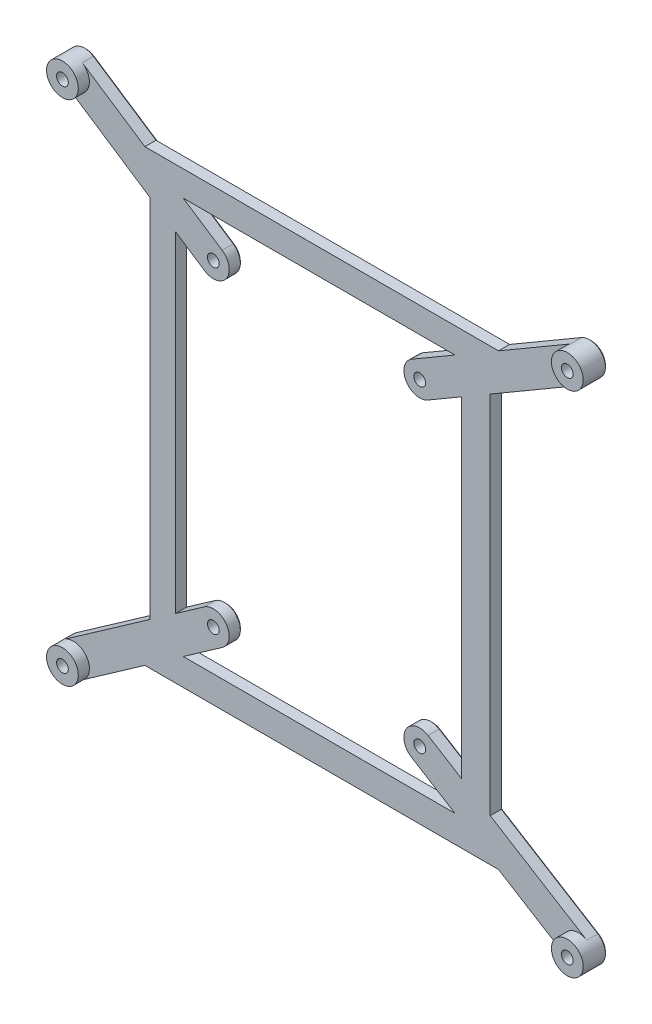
from build123d import *

# Parameters (mm, degrees)
SKIZZE1_R                       = 1.85
AUFSATZ_LINEAR_AUSTRAGEN1_DEPTH = 4
AUFSATZ_LINEAR_START            = 3.5
SKIZZE5_R                       = 5
SKIZZE5_R_2                     = 1.85
SKIZZE5_R_3                     = 5.007765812
AUFSATZ_LINEAR_AUSTRAGEN2_DEPTH = 3.5
FASE1_SIZE                      = 0.5


with BuildPart() as part:
    # Skizze1 → Aufsatz-Linear austragen1 (new body)
    with BuildSketch(Plane.XY):
        with BuildLine():
            Line((82.131309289, -75.729257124), (51.73225298, -56.955695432))
            Line((51.73225298, -56.955695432), (51.73225298, 58.029185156))
            Line((51.73225298, 58.029185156), (82.018763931, 75.690760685))
            ThreePointArc((82.018763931, 75.690760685), (83.819239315, 82.528763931), (76.981236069, 84.329239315))
            Line((76.981236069, 84.329239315), (54.347088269, 71.130138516))
            Line((54.347088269, 71.130138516), (-57.023078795, 71.130138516))
            Line((-57.023078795, 71.130138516), (-76.740500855, 84.179552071))
            ThreePointArc((-76.740500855, 84.179552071), (-83.669552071, 82.769499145), (-82.259499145, 75.840447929))
            Line((-82.259499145, 75.840447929), (-55.347011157, 58.029185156))
            Line((-55.347011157, 58.029185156), (-55.347011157, -56.955695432))
            Line((-55.347011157, -56.955695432), (-82.369745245, -75.895544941))
            ThreePointArc((-82.369745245, -75.895544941), (-83.594455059, -82.859745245), (-76.630254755, -84.084455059))
            Line((-76.630254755, -84.084455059), (-57.023078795, -70.342064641))
            Line((-57.023078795, -70.342064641), (54.347088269, -70.342064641))
            Line((54.347088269, -70.342064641), (76.868690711, -84.250742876))
            ThreePointArc((76.868690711, -84.250742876), (83.760742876, -82.621309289), (82.131309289, -75.729257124))
        make_face()
        with Locations((-35.469999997, -49.13)):
            Circle(SKIZZE1_R, mode=Mode.SUBTRACT)
        with Locations((29.530000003, -49.13)):
            Circle(SKIZZE1_R, mode=Mode.SUBTRACT)
        with Locations(Location((29.530000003, 50.87, 0), (0, 0, 180))):
            Circle(SKIZZE1_R, mode=Mode.SUBTRACT)
        with Locations(Location((-35.469999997, 50.87, 0), (0, 0, 180))):
            Circle(SKIZZE1_R, mode=Mode.SUBTRACT)
        with Locations((-79.5, 80.01)):
            Circle(SKIZZE1_R, mode=Mode.SUBTRACT)
        with Locations((79.5, 80.01)):
            Circle(SKIZZE1_R, mode=Mode.SUBTRACT)
        with Locations((79.5, -79.99)):
            Circle(SKIZZE1_R, mode=Mode.SUBTRACT)
        with Locations((-79.5, -79.99)):
            Circle(SKIZZE1_R, mode=Mode.SUBTRACT)
        with BuildLine():
            Line((-38.339745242, -45.035544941), (-47.347011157, -51.348609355))
            Line((-47.347011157, -51.348609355), (-47.347011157, 52.734613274))
            Line((-47.347011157, 52.734613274), (-38.229499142, 46.700447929))
            ThreePointArc((-38.229499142, 46.700447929), (-31.300447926, 48.110500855), (-32.710500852, 55.039552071))
            Line((-32.710500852, 55.039552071), (-44.935227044, 63.130138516))
            Line((-44.935227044, 63.130138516), (40.628488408, 63.130138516))
            Line((40.628488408, 63.130138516), (27.011236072, 55.189239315))
            ThreePointArc((27.011236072, 55.189239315), (25.210760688, 48.351236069), (32.048763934, 46.550760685))
            Line((32.048763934, 46.550760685), (42.652988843, 52.734613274))
            Line((42.652988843, 52.734613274), (42.652988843, -51.348609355))
            Line((42.652988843, -51.348609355), (32.161309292, -44.869257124))
            ThreePointArc((32.161309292, -44.869257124), (25.269257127, -46.498690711), (26.898690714, -53.390742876))
            Line((26.898690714, -53.390742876), (40.628488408, -61.869861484))
            Line((40.628488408, -61.869861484), (-44.935227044, -61.869861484))
            Line((-44.935227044, -61.869861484), (-32.600254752, -53.224455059))
            ThreePointArc((-32.600254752, -53.224455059), (-31.375544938, -46.260254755), (-38.339745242, -45.035544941))
        make_face(mode=Mode.SUBTRACT)
    extrude(amount=-AUFSATZ_LINEAR_AUSTRAGEN1_DEPTH)

    # Skizze5 → Aufsatz-Linear austragen2 (add)
    # profile 1 of 4: a face of its own
    with BuildSketch(Plane.XY.offset(AUFSATZ_LINEAR_START)):
        with Locations((-79.5, -79.99)):
            Circle(SKIZZE5_R)
        with Locations((-79.5, -79.99)):
            Circle(SKIZZE5_R_2, mode=Mode.SUBTRACT)
    # profile 2 of 4: a face of its own
    with BuildSketch(Plane.XY.offset(AUFSATZ_LINEAR_START)):
        with Locations((79.5, -79.99)):
            Circle(SKIZZE5_R_3)
        with Locations((79.5, -79.99)):
            Circle(SKIZZE5_R_2, mode=Mode.SUBTRACT)
    # profile 3 of 4: a face of its own
    with BuildSketch(Plane.XY.offset(AUFSATZ_LINEAR_START)):
        with Locations((-79.5, 80.01)):
            Circle(SKIZZE5_R)
        with Locations((-79.5, 80.01)):
            Circle(SKIZZE5_R_2, mode=Mode.SUBTRACT)
    # profile 4 of 4: a face of its own
    with BuildSketch(Plane.XY.offset(AUFSATZ_LINEAR_START)):
        with Locations((79.5, 80.01)):
            Circle(SKIZZE5_R)
        with Locations((79.5, 80.01)):
            Circle(SKIZZE5_R_2, mode=Mode.SUBTRACT)
    extrude(amount=-AUFSATZ_LINEAR_AUSTRAGEN2_DEPTH)

    # Fase1
    fase1_edges = [part.edges().sort_by_distance(p)[0] for p in [
        (-81.35, -79.99, -4),
        (31.380000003, 50.87, -4),
        (-33.619999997, 50.87, -4),
        (-81.35, 80.01, -4),
        (-68.858378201, -66.425620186, -4),
        (-83.594455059, -82.859745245, -4),
        (-66.826666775, -77.21325985, -4),
        (-1.337995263, -70.342064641, -4),
        (65.60788949, -77.296403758, -4),
        (83.760742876, -82.621309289, -4),
        (66.931781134, -66.342476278, -4),
        (51.73225298, 0.536744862, -4),
        (66.875508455, 66.859972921, -4),
        (83.819239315, 82.528763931, -4),
        (-68.803255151, 66.934816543, -4),
        (-31.375544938, -46.260254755, -4),
        (-42.843378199, -48.192077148, -4),
        (65.664162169, 77.729688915, -4),
        (-47.347011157, 0.69300196, -4),
        (-42.788255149, 49.717530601, -4),
        (-31.300447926, 48.110500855, -4),
        (-38.822863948, 59.084845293, -4),
        (-2.153369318, 63.130138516, -4),
        (33.81986224, 59.159688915, -4),
        (25.210760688, 48.351236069, -4),
        (37.350876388, 49.642686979, -4),
        (42.652988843, 0.69300196, -4),
        (37.407149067, -48.108933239, -4),
        (-1.337995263, 71.130138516, -4),
        (25.269257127, -46.498690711, -4),
        (33.763589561, -57.63030218, -4),
        (-2.153369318, -61.869861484, -4),
        (-38.767740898, -57.547158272, -4),
        (-66.881789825, 77.654845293, -4),
        (-83.669552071, 82.769499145, -4),
        (-37.319999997, -49.13, -4),
        (27.680000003, -49.13, -4),
        (-55.347011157, 0.536744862, -4),
        (77.65, 80.01, -4),
        (77.65, -79.99, -4),
    ]]
    chamfer(fase1_edges, length=FASE1_SIZE)


solid = part.part
